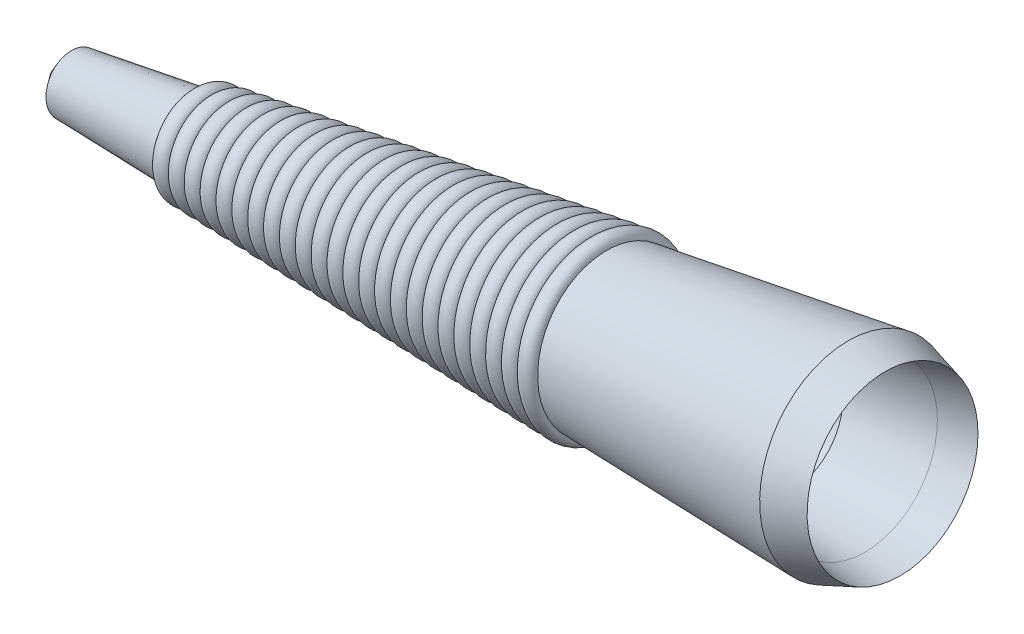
from build123d import *


with BuildPart() as part:
    # Sketch1 → Revolve2 (revolve)
    with BuildSketch(Plane.XY):
        with BuildLine():
            Line((0, 0), (6.35, -6.35))
            Line((6.35, -6.35), (50.8, -6.35))
            ThreePointArc((50.8, -6.35), (53.975, -9.525), (57.15, -6.35))
            ThreePointArc((57.15, -6.35), (60.325, -9.525), (63.5, -6.35))
            ThreePointArc((63.5, -6.35), (66.675, -9.525), (69.85, -6.35))
            ThreePointArc((69.85, -6.35), (73.025, -9.525), (76.2, -6.35))
            ThreePointArc((76.2, -6.35), (79.375, -9.525), (82.55, -6.35))
            ThreePointArc((82.55, -6.35), (85.725, -9.525), (88.9, -6.35))
            ThreePointArc((88.9, -6.35), (92.075, -9.525), (95.25, -6.35))
            ThreePointArc((95.25, -6.35), (98.425, -9.525), (101.6, -6.35))
            ThreePointArc((101.6, -6.35), (104.775, -9.525), (107.95, -6.35))
            ThreePointArc((107.95, -6.35), (111.125, -9.525), (114.3, -6.35))
            ThreePointArc((114.3, -6.35), (117.475, -9.525), (120.65, -6.35))
            ThreePointArc((120.65, -6.35), (123.825, -9.525), (127, -6.35))
            ThreePointArc((127, -6.35), (130.175, -9.525), (133.35, -6.35))
            ThreePointArc((133.35, -6.35), (136.525, -9.525), (139.7, -6.35))
            ThreePointArc((139.7, -6.35), (142.875, -9.525), (146.05, -6.35))
            ThreePointArc((146.05, -6.35), (149.225, -9.525), (152.4, -6.35))
            ThreePointArc((152.4, -6.35), (155.575, -9.525), (158.75, -6.35))
            ThreePointArc((158.75, -6.35), (161.925, -9.525), (165.1, -6.35))
            ThreePointArc((165.1, -6.35), (168.275, -9.525), (171.45, -6.35))
            ThreePointArc((171.45, -6.35), (174.625, -9.525), (177.8, -6.35))
            ThreePointArc((177.8, -6.35), (180.975, -9.525), (184.15, -6.35))
            ThreePointArc((184.15, -6.35), (187.325, -9.525), (190.5, -6.35))
            ThreePointArc((190.5, -6.35), (193.675, -9.525), (196.85, -6.35))
            ThreePointArc((196.85, -6.35), (200.025, -9.525), (203.2, -6.35))
            Line((203.2, -6.35), (292.1, -6.35))
            Line((292.1, -6.35), (304.8, -1.111106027))
            Line((304.8, -1.111106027), (292.1, 0))
            Line((292.1, 0), (259.461664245, 0))
            Line((259.461664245, 0), (265.811664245, 6.35))
            Line((265.811664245, 6.35), (262.636664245, 6.35))
            Line((262.636664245, 6.35), (256.286664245, 0))
            Line((256.286664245, 0), (243.586664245, 0))
            Line((243.586664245, 0), (249.936664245, 6.35))
            Line((249.936664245, 6.35), (246.761664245, 6.35))
            Line((246.761664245, 6.35), (240.411664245, 0))
            Line((240.411664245, 0), (227.711664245, 0))
            Line((227.711664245, 0), (234.061664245, 6.35))
            Line((234.061664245, 6.35), (230.886664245, 6.35))
            Line((230.886664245, 6.35), (224.536664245, 0))
            Line((224.536664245, 0), (211.836664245, 0))
            Line((211.836664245, 0), (218.186664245, 6.35))
            Line((218.186664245, 6.35), (215.011664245, 6.35))
            Line((215.011664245, 6.35), (208.661664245, 0))
            Line((208.661664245, 0), (195.961664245, 0))
            Line((195.961664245, 0), (202.311664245, 6.35))
            Line((202.311664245, 6.35), (199.136664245, 6.35))
            Line((199.136664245, 6.35), (192.786664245, 0))
            Line((192.786664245, 0), (180.086664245, 0))
            Line((180.086664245, 0), (186.436664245, 6.35))
            Line((186.436664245, 6.35), (183.261664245, 6.35))
            Line((183.261664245, 6.35), (176.911664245, 0))
            Line((176.911664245, 0), (164.211664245, 0))
            Line((164.211664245, 0), (170.561664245, 6.35))
            Line((170.561664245, 6.35), (167.386664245, 6.35))
            Line((167.386664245, 6.35), (161.036664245, 0))
            Line((161.036664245, 0), (148.336664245, 0))
            Line((148.336664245, 0), (154.686664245, 6.35))
            Line((154.686664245, 6.35), (151.511664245, 6.35))
            Line((151.511664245, 6.35), (145.161664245, 0))
            Line((145.161664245, 0), (132.461664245, 0))
            Line((132.461664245, 0), (138.811664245, 6.35))
            Line((138.811664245, 6.35), (135.636664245, 6.35))
            Line((135.636664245, 6.35), (129.286664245, 0))
            Line((129.286664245, 0), (116.586664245, 0))
            Line((116.586664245, 0), (122.936664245, 6.35))
            Line((122.936664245, 6.35), (119.761664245, 6.35))
            Line((119.761664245, 6.35), (113.411664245, 0))
            Line((113.411664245, 0), (100.711664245, 0))
            Line((100.711664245, 0), (107.061664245, 6.35))
            Line((107.061664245, 6.35), (103.886664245, 6.35))
            Line((103.886664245, 6.35), (97.536664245, 0))
            Line((97.536664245, 0), (0, 0))
        make_face()
    revolve(axis=Axis((29.791985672, 5.793588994, 0), (0.9961946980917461, 0.08715574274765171, 0)))


solid = part.part
